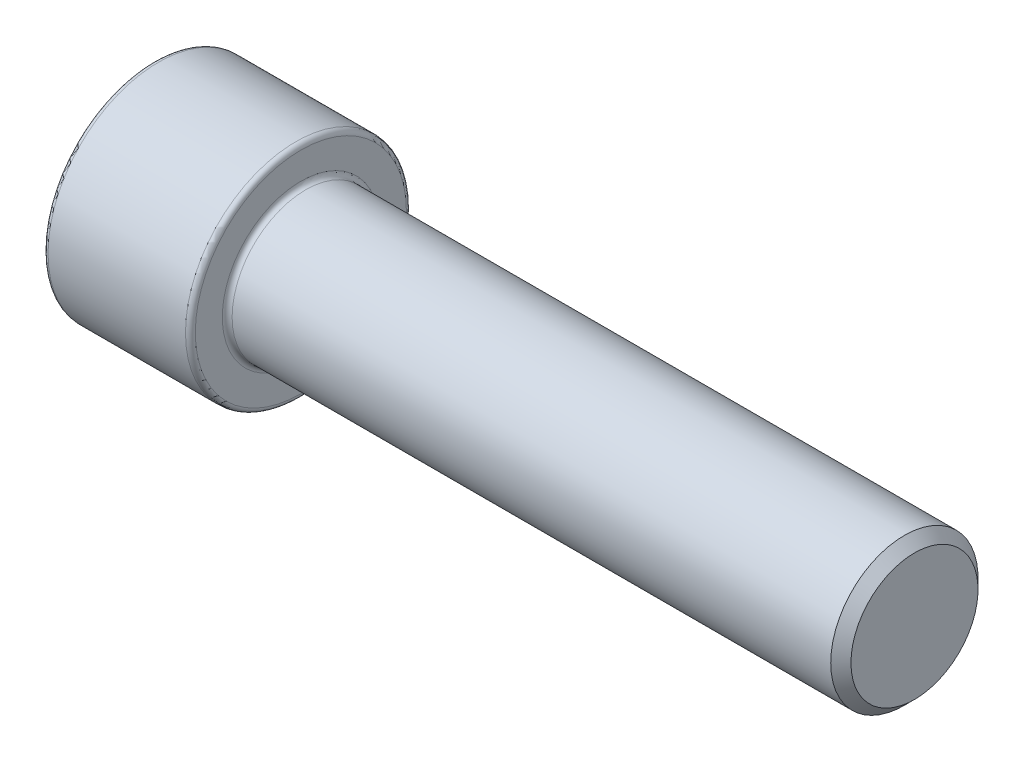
from build123d import *

# Parameters (mm, degrees)
BASEHEADSKE_R   = 18
BASEHEAD_DEPTH  = 24
CUTSOCKET_DEPTH = 12
FILLET_2_R      = 0.8


with BuildPart() as part:
    # BaseHeadSke → BaseHead (new body)
    with BuildSketch(Plane(origin=(0, 0, 0), x_dir=(0, 0, -1), z_dir=(1, 0, 0))):
        Circle(BASEHEADSKE_R)
    extrude(amount=BASEHEAD_DEPTH)

    # BodySke → BaseBody (revolve)
    with BuildSketch(Plane.XY, mode=Mode.PRIVATE) as basebody_sk:
        Polygon((0, 0), (124, 0), (124, 10.352), (122.352, 12), (0, 12), align=None)
    revolve(basebody_sk.sketch.rotate(Axis((0, 0, 0), (1, 0, 0)), 90), axis=Axis((0, 0, 0), (1, 0, 0)))

    # CutSocketSke → CutSocket (cut)
    with BuildSketch(Plane(origin=(0, 0, 0), x_dir=(0, 0, -1), z_dir=(1, 0, 0))):
        Polygon((0, 10.969655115), (-9.5, 5.484827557), (-9.5, -5.484827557), (0, -10.969655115), (9.5, -5.484827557), (9.5, 5.484827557), align=None)
    extrude(amount=CUTSOCKET_DEPTH, mode=Mode.SUBTRACT)

    # CutHoleSke → CutHole (revolve, cut)
    with BuildSketch(Plane.XY, mode=Mode.PRIVATE) as cuthole_sk:
        Polygon((0, 9.5), (13.6, 9.5), (19.084827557, 0), (0, 0), align=None)
    revolve(cuthole_sk.sketch.rotate(Axis((0, 0, 0), (1, 0, 0)), 90), axis=Axis((0, 0, 0), (1, 0, 0)), mode=Mode.SUBTRACT)

    # Fillet 2
    fillet_2_edges = [part.edges().sort_by_distance(p)[0] for p in [
        (0, 0, 18),
        (24, 0, 18),
        (24, 0, -12),
    ]]
    fillet(fillet_2_edges, radius=FILLET_2_R)


solid = part.part
